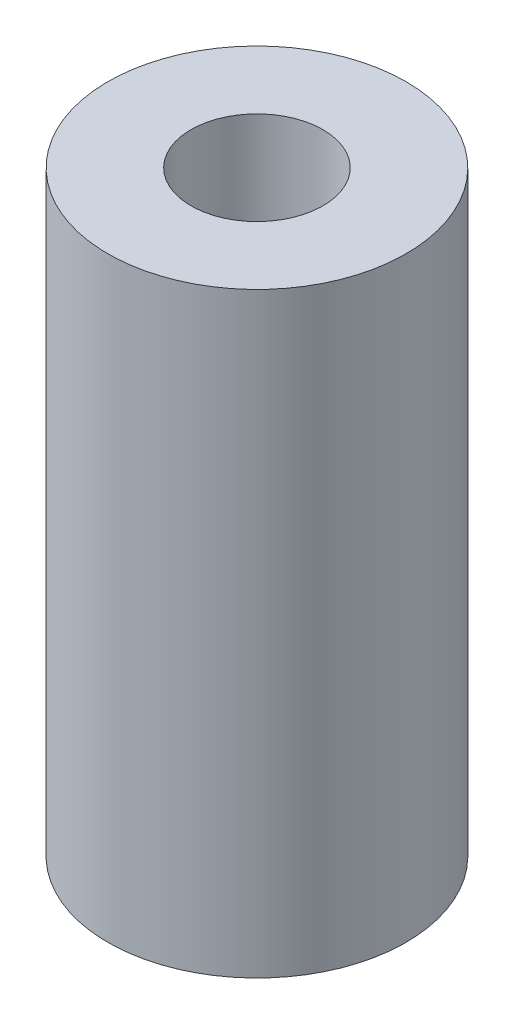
from build123d import *

# Parameters (mm, degrees)
SKETCH1_R          = 4.7625
EXTRUDE1_DEPTH     = 19.05
SKETCH2_R          = 2.1082
CUT_EXTRUDE2_DEPTH = 21.205576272


with BuildPart() as part:
    # Sketch1 → Extrude1 (new body)
    with BuildSketch(Plane(origin=(0, 0, 0), x_dir=(1, 0, 0), z_dir=(0, 1, 0))):
        with Locations(Location((0, 0, 0), (0, 0, 90))):
            Circle(SKETCH1_R)
    extrude(amount=EXTRUDE1_DEPTH)

    # Sketch2 → Cut-Extrude2 (cut, through all)
    with BuildSketch(Plane(origin=(0, 0, 0), x_dir=(1, 0, 0), z_dir=(0, 1, 0))):
        with Locations(Location((0, 0, 0), (0, 0, 90))):
            Circle(SKETCH2_R)
    extrude(amount=CUT_EXTRUDE2_DEPTH, mode=Mode.SUBTRACT)


solid = part.part
